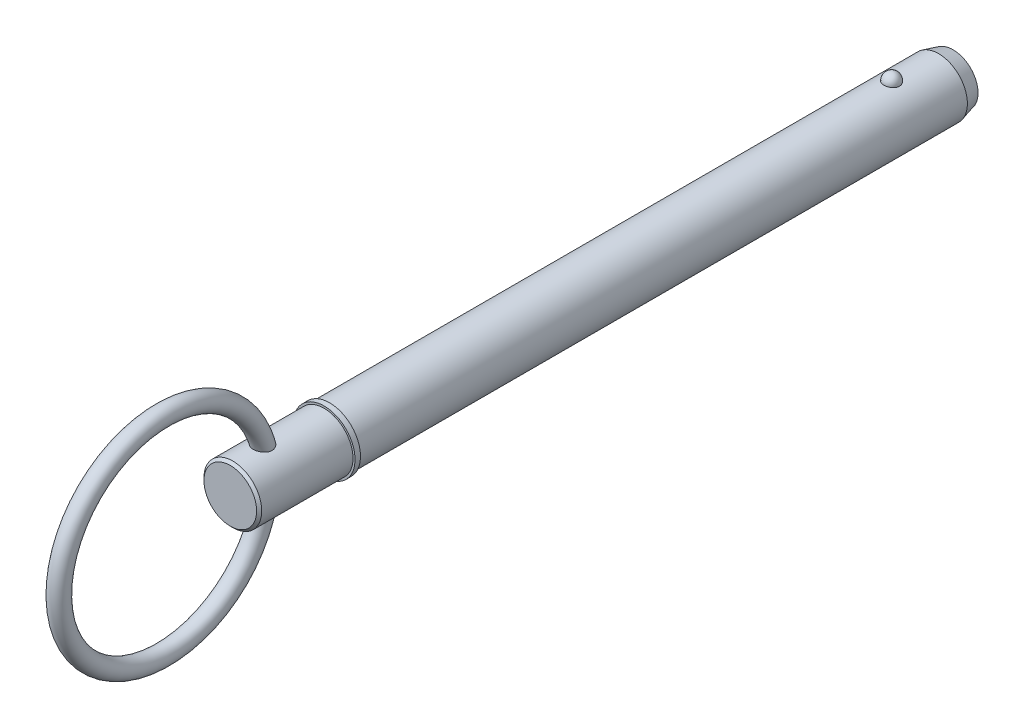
ISO-10303-21;
HEADER;
FILE_DESCRIPTION(('STEP AP214'),'2;1');
FILE_NAME('part.step','',(''),(''),'','','');
FILE_SCHEMA(('AUTOMOTIVE_DESIGN { 1 0 10303 214 1 1 1 1 }'));
ENDSEC;
DATA;
#1=APPLICATION_CONTEXT('core data for automotive mechanical design processes');
#2=APPLICATION_PROTOCOL_DEFINITION('international standard','automotive_design',2000,#1);
#3=PRODUCT_CONTEXT('',#1,'mechanical');
#4=PRODUCT('Part','Part','',(#3));
#5=PRODUCT_RELATED_PRODUCT_CATEGORY('part','',(#4));
#6=PRODUCT_DEFINITION_FORMATION('','',#4);
#7=PRODUCT_DEFINITION_CONTEXT('part definition',#1,'design');
#8=PRODUCT_DEFINITION('design','',#6,#7);
#9=PRODUCT_DEFINITION_SHAPE('','',#8);
#10=(LENGTH_UNIT() NAMED_UNIT(*) SI_UNIT(.MILLI.,.METRE.));
#11=(NAMED_UNIT(*) PLANE_ANGLE_UNIT() SI_UNIT($,.RADIAN.));
#12=(NAMED_UNIT(*) SI_UNIT($,.STERADIAN.) SOLID_ANGLE_UNIT());
#13=UNCERTAINTY_MEASURE_WITH_UNIT(LENGTH_MEASURE(1.E-05),#10,'distance_accuracy_value','');
#14=(GEOMETRIC_REPRESENTATION_CONTEXT(3) GLOBAL_UNCERTAINTY_ASSIGNED_CONTEXT((#13)) GLOBAL_UNIT_ASSIGNED_CONTEXT((#10,
#11,#12)) REPRESENTATION_CONTEXT('',''));
#15=CARTESIAN_POINT('',(0.,0.,0.));
#16=DIRECTION('',(0.,0.,1.));
#17=DIRECTION('',(1.,0.,0.));
#18=AXIS2_PLACEMENT_3D('',#15,#16,#17);
#19=CARTESIAN_POINT('',(0.,0.,152.4));
#20=DIRECTION('',(0.,0.,-1.));
#21=DIRECTION('',(-1.,0.,0.));
#22=AXIS2_PLACEMENT_3D('',#19,#20,#21);
#23=CYLINDRICAL_SURFACE('',#22,7.94);
#24=CARTESIAN_POINT('',(2.13020349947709,7.64891057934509,-2.14999999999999));
#25=CARTESIAN_POINT('',(2.1302012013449,7.64891247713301,-2.02978166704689));
#26=CARTESIAN_POINT('',(2.12037546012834,7.65166842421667,-1.90953383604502));
#27=CARTESIAN_POINT('',(2.08130792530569,7.66238579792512,-1.67243962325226));
#28=CARTESIAN_POINT('',(2.05205785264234,7.67034944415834,-1.55559471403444));
#29=CARTESIAN_POINT('',(1.97489181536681,7.69057749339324,-1.32869361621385));
#30=CARTESIAN_POINT('',(1.92698409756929,7.70283999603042,-1.21863445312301));
#31=CARTESIAN_POINT('',(1.81370645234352,7.73029430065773,-1.00831338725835));
#32=CARTESIAN_POINT('',(1.74833715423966,7.7454859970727,-0.908051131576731));
#33=CARTESIAN_POINT('',(1.60144242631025,7.77718699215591,-0.719628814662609));
#34=CARTESIAN_POINT('',(1.51984382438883,7.79370204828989,-0.631526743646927));
#35=CARTESIAN_POINT('',(1.34279837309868,7.82614685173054,-0.47041117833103));
#36=CARTESIAN_POINT('',(1.24735148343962,7.84207659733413,-0.39739772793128));
#37=CARTESIAN_POINT('',(1.04544839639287,7.87153116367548,-0.268681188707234));
#38=CARTESIAN_POINT('',(0.939022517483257,7.88506234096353,-0.212932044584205));
#39=CARTESIAN_POINT('',(0.717931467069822,7.90825597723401,-0.120080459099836));
#40=CARTESIAN_POINT('',(0.603267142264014,7.9179188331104,-0.0829761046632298));
#41=CARTESIAN_POINT('',(0.371015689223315,7.93216561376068,-0.0289596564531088));
#42=CARTESIAN_POINT('',(0.253510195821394,7.93683225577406,-0.0117183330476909));
#43=CARTESIAN_POINT('',(0.0171784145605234,7.94086051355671,0.00318921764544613));
#44=CARTESIAN_POINT('',(-0.101647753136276,7.94022260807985,0.000857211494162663));
#45=CARTESIAN_POINT('',(-0.335567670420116,7.93375751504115,-0.0231465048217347));
#46=CARTESIAN_POINT('',(-0.450690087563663,7.92799987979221,-0.0445590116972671));
#47=CARTESIAN_POINT('',(-0.675610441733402,7.91200792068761,-0.105760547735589));
#48=CARTESIAN_POINT('',(-0.785408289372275,7.90177352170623,-0.145549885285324));
#49=CARTESIAN_POINT('',(-0.997270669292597,7.87784802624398,-0.242675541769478));
#50=CARTESIAN_POINT('',(-1.0992893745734,7.86413823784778,-0.300107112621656));
#51=CARTESIAN_POINT('',(-1.29223659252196,7.83474718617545,-0.430887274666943));
#52=CARTESIAN_POINT('',(-1.38316404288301,7.81906573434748,-0.504237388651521));
#53=CARTESIAN_POINT('',(-1.55313516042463,7.78710451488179,-0.666358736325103));
#54=CARTESIAN_POINT('',(-1.63193689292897,7.77081906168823,-0.755382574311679));
#55=CARTESIAN_POINT('',(-1.77366356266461,7.73970270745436,-0.945507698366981));
#56=CARTESIAN_POINT('',(-1.83658745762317,7.72487190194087,-1.04660977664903));
#57=CARTESIAN_POINT('',(-1.94556640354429,7.6981535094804,-1.25927689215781));
#58=CARTESIAN_POINT('',(-1.99143480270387,7.6862989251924,-1.37094182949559));
#59=CARTESIAN_POINT('',(-2.06418311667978,7.66708387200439,-1.60066153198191));
#60=CARTESIAN_POINT('',(-2.0910635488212,7.65972328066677,-1.71871612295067));
#61=CARTESIAN_POINT('',(-2.12508507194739,7.65035479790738,-1.95736076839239));
#62=CARTESIAN_POINT('',(-2.13230490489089,7.64832555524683,-2.07793875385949));
#63=CARTESIAN_POINT('',(-2.12704767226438,7.64978921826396,-2.31862835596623));
#64=CARTESIAN_POINT('',(-2.1145710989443,7.6532819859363,-2.43873998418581));
#65=CARTESIAN_POINT('',(-2.07034166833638,7.66536368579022,-2.67451689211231));
#66=CARTESIAN_POINT('',(-2.03867758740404,7.67392914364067,-2.79020005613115));
#67=CARTESIAN_POINT('',(-1.95694065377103,7.69517736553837,-3.01446692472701));
#68=CARTESIAN_POINT('',(-1.90686710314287,7.70786028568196,-3.12305035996));
#69=CARTESIAN_POINT('',(-1.78925555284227,7.73600831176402,-3.33065971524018));
#70=CARTESIAN_POINT('',(-1.72162904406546,7.75148739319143,-3.42963360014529));
#71=CARTESIAN_POINT('',(-1.57074739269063,7.78346215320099,-3.61466914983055));
#72=CARTESIAN_POINT('',(-1.48749169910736,7.79995786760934,-3.70073035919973));
#73=CARTESIAN_POINT('',(-1.30720250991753,7.83219119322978,-3.8578359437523));
#74=CARTESIAN_POINT('',(-1.2101234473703,7.84792605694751,-3.92882863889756));
#75=CARTESIAN_POINT('',(-1.00503150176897,7.87681523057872,-4.05342383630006));
#76=CARTESIAN_POINT('',(-0.897019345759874,7.88996971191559,-4.10702749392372));
#77=CARTESIAN_POINT('',(-0.674439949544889,7.91208451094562,-4.19477736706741));
#78=CARTESIAN_POINT('',(-0.559965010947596,7.92109245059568,-4.22914554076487));
#79=CARTESIAN_POINT('',(-0.326625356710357,7.93413878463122,-4.27838865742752));
#80=CARTESIAN_POINT('',(-0.207761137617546,7.93817773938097,-4.29326579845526));
#81=CARTESIAN_POINT('',(0.0287357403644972,7.94081322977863,-4.3030062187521));
#82=CARTESIAN_POINT('',(0.146353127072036,7.93950453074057,-4.29821797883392));
#83=CARTESIAN_POINT('',(0.379062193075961,7.93180098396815,-4.26955229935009));
#84=CARTESIAN_POINT('',(0.494153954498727,7.92540630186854,-4.24567548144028));
#85=CARTESIAN_POINT('',(0.718185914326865,7.90824874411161,-4.17962260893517));
#86=CARTESIAN_POINT('',(0.827145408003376,7.89750055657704,-4.13750805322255));
#87=CARTESIAN_POINT('',(1.03638036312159,7.87277755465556,-4.03615078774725));
#88=CARTESIAN_POINT('',(1.13665531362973,7.85880255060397,-3.97690707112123));
#89=CARTESIAN_POINT('',(1.32729731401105,7.82887859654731,-3.84189297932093));
#90=CARTESIAN_POINT('',(1.41749828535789,7.81290379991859,-3.76589388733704));
#91=CARTESIAN_POINT('',(1.58397257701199,7.78086330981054,-3.59992466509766));
#92=CARTESIAN_POINT('',(1.66024342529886,7.76479760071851,-3.50995206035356));
#93=CARTESIAN_POINT('',(1.79805631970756,7.73405928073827,-3.31688321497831));
#94=CARTESIAN_POINT('',(1.85933944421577,7.719413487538,-3.213597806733));
#95=CARTESIAN_POINT('',(1.96397499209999,7.69345992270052,-2.99796163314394));
#96=CARTESIAN_POINT('',(2.00733488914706,7.68215076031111,-2.88561466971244));
#97=CARTESIAN_POINT('',(2.07068045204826,7.66529896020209,-2.6699413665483));
#98=CARTESIAN_POINT('',(2.09296296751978,7.65919990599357,-2.56732606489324));
#99=CARTESIAN_POINT('',(2.12272535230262,7.65100492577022,-2.35981463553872));
#100=CARTESIAN_POINT('',(2.13020550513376,7.64890892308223,-2.25491855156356));
#101=CARTESIAN_POINT('',(2.13020349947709,7.64891057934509,-2.14999999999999));
#102=B_SPLINE_CURVE_WITH_KNOTS('',3,(#24,#25,#26,#27,#28,#29,#30,#31,#32,#33,#34,#35,#36,#37,
#38,#39,#40,#41,#42,#43,#44,#45,#46,#47,#48,#49,#50,#51,#52,#53,#54,#55,#56,#57,#58,#59,#60,#61,
#62,#63,#64,#65,#66,#67,#68,#69,#70,#71,#72,#73,#74,#75,#76,#77,#78,#79,#80,#81,#82,#83,#84,#85,
#86,#87,#88,#89,#90,#91,#92,#93,#94,#95,#96,#97,#98,#99,#100,#101),.UNSPECIFIED.,.T.,.F.,(4,2,2,
2,2,2,2,2,2,2,2,2,2,2,2,2,2,2,2,2,2,2,2,2,2,2,2,2,2,2,2,2,2,2,2,2,2,2,4),(0.,0.360277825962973,
0.720709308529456,1.0809816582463,1.44124102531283,1.80316307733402,2.16508618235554,
2.52603531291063,2.88694740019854,3.24178717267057,3.59659491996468,3.94665496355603,
4.2967208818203,4.6487110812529,5.00073496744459,5.35906196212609,5.71741247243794,
6.079576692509,6.44173104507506,6.80243279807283,7.16312553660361,7.52216203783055,
7.88121215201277,8.24210915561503,8.60301888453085,8.96514709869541,9.32725124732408,
9.68508606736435,10.0428805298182,10.3943622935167,10.7458326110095,11.0961268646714,
11.4464417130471,11.8018724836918,12.1573662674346,12.5186252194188,12.8797333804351,
13.1941658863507,13.5085923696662),.UNSPECIFIED.);
#103=CARTESIAN_POINT('',(2.13020349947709,7.64891057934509,-2.14999999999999));
#104=VERTEX_POINT('',#103);
#105=EDGE_CURVE('E102',#104,#104,#102,.T.);
#106=ORIENTED_EDGE('',*,*,#105,.T.);
#107=EDGE_LOOP('',(#106));
#108=FACE_BOUND('',#107,.T.);
#109=CARTESIAN_POINT('',(0.,0.,-15.0500000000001));
#110=DIRECTION('',(0.,0.,-1.));
#111=DIRECTION('',(-1.,0.,0.));
#112=AXIS2_PLACEMENT_3D('',#109,#110,#111);
#113=CIRCLE('',#112,7.94);
#114=CARTESIAN_POINT('',(-7.94,0.,-15.0500000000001));
#115=VERTEX_POINT('',#114);
#116=EDGE_CURVE('E109',#115,#115,#113,.F.);
#117=ORIENTED_EDGE('',*,*,#116,.T.);
#118=EDGE_LOOP('',(#117));
#119=FACE_BOUND('',#118,.T.);
#120=CARTESIAN_POINT('',(0.,0.,152.4));
#121=DIRECTION('',(0.,0.,1.));
#122=DIRECTION('',(1.,0.,0.));
#123=AXIS2_PLACEMENT_3D('',#120,#121,#122);
#124=CIRCLE('',#123,7.94);
#125=CARTESIAN_POINT('',(7.94,0.,152.4));
#126=VERTEX_POINT('',#125);
#127=EDGE_CURVE('E107',#126,#126,#124,.T.);
#128=ORIENTED_EDGE('',*,*,#127,.F.);
#129=EDGE_LOOP('',(#128));
#130=FACE_BOUND('',#129,.T.);
#131=ADVANCED_FACE('F39',(#108,#119,#130),#23,.T.);
#132=CARTESIAN_POINT('',(0.,0.,-19.05));
#133=DIRECTION('',(0.,0.,-1.));
#134=DIRECTION('',(-1.,0.,0.));
#135=AXIS2_PLACEMENT_3D('',#132,#133,#134);
#136=PLANE('',#135);
#137=CARTESIAN_POINT('',(0.,0.,-19.05));
#138=DIRECTION('',(0.,0.,-1.));
#139=DIRECTION('',(-1.,0.,0.));
#140=AXIS2_PLACEMENT_3D('',#137,#138,#139);
#141=CIRCLE('',#140,6.86820323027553);
#142=CARTESIAN_POINT('',(-6.86820323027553,0.,-19.05));
#143=VERTEX_POINT('',#142);
#144=EDGE_CURVE('E143',#143,#143,#141,.T.);
#145=ORIENTED_EDGE('',*,*,#144,.T.);
#146=EDGE_LOOP('',(#145));
#147=FACE_BOUND('',#146,.T.);
#148=ADVANCED_FACE('F88',(#147),#136,.T.);
#149=CARTESIAN_POINT('',(0.,0.,-19.05));
#150=DIRECTION('',(0.,0.,1.));
#151=DIRECTION('',(1.,0.,0.));
#152=AXIS2_PLACEMENT_3D('',#149,#150,#151);
#153=CONICAL_SURFACE('',#152,6.86820323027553,0.261799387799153);
#154=ORIENTED_EDGE('',*,*,#116,.F.);
#155=EDGE_LOOP('',(#154));
#156=FACE_BOUND('',#155,.T.);
#157=ORIENTED_EDGE('',*,*,#144,.F.);
#158=EDGE_LOOP('',(#157));
#159=FACE_BOUND('',#158,.T.);
#160=ADVANCED_FACE('F94',(#156,#159),#153,.T.);
#161=CARTESIAN_POINT('',(0.,7.94,-2.14999999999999));
#162=DIRECTION('',(0.,1.,0.));
#163=DIRECTION('',(0.,0.,1.));
#164=AXIS2_PLACEMENT_3D('',#161,#162,#163);
#165=SPHERICAL_SURFACE('',#164,2.15);
#166=ORIENTED_EDGE('',*,*,#105,.F.);
#167=EDGE_LOOP('',(#166));
#168=FACE_BOUND('',#167,.T.);
#169=ADVANCED_FACE('F112',(#168),#165,.T.);
#170=CARTESIAN_POINT('',(0.,0.,152.4));
#171=DIRECTION('',(0.,0.,-1.));
#172=DIRECTION('',(-1.,0.,0.));
#173=AXIS2_PLACEMENT_3D('',#170,#171,#172);
#174=PLANE('',#173);
#175=ORIENTED_EDGE('',*,*,#127,.T.);
#176=EDGE_LOOP('',(#175));
#177=FACE_BOUND('',#176,.T.);
#178=CARTESIAN_POINT('',(0.,0.,152.4));
#179=DIRECTION('',(0.,0.,-1.));
#180=DIRECTION('',(-1.,0.,0.));
#181=AXIS2_PLACEMENT_3D('',#178,#179,#180);
#182=CIRCLE('',#181,8.5);
#183=CARTESIAN_POINT('',(-8.5,0.,152.4));
#184=VERTEX_POINT('',#183);
#185=EDGE_CURVE('E108',#184,#184,#182,.T.);
#186=ORIENTED_EDGE('',*,*,#185,.T.);
#187=EDGE_LOOP('',(#186));
#188=FACE_BOUND('',#187,.T.);
#189=ADVANCED_FACE('F116',(#177,#188),#174,.T.);
#190=CARTESIAN_POINT('',(0.,0.,33.7287874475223));
#191=DIRECTION('',(0.,0.,-1.));
#192=DIRECTION('',(-1.,0.,0.));
#193=AXIS2_PLACEMENT_3D('',#190,#191,#192);
#194=CYLINDRICAL_SURFACE('',#193,8.5);
#195=CARTESIAN_POINT('',(0.,0.,153.9));
#196=DIRECTION('',(0.,0.,-1.));
#197=DIRECTION('',(-1.,0.,0.));
#198=AXIS2_PLACEMENT_3D('',#195,#196,#197);
#199=CIRCLE('',#198,8.5);
#200=CARTESIAN_POINT('',(-8.5,0.,153.9));
#201=VERTEX_POINT('',#200);
#202=EDGE_CURVE('E133',#201,#201,#199,.T.);
#203=ORIENTED_EDGE('',*,*,#202,.T.);
#204=EDGE_LOOP('',(#203));
#205=FACE_BOUND('',#204,.T.);
#206=ORIENTED_EDGE('',*,*,#185,.F.);
#207=EDGE_LOOP('',(#206));
#208=FACE_BOUND('',#207,.T.);
#209=ADVANCED_FACE('F120',(#205,#208),#194,.T.);
#210=CARTESIAN_POINT('',(0.,8.5,153.9));
#211=DIRECTION('',(0.,0.,1.));
#212=DIRECTION('',(1.,0.,0.));
#213=AXIS2_PLACEMENT_3D('',#210,#211,#212);
#214=PLANE('',#213);
#215=CARTESIAN_POINT('',(0.,0.,153.9));
#216=DIRECTION('',(0.,0.,1.));
#217=DIRECTION('',(1.,0.,0.));
#218=AXIS2_PLACEMENT_3D('',#215,#216,#217);
#219=CIRCLE('',#218,7.94);
#220=CARTESIAN_POINT('',(7.94,0.,153.9));
#221=VERTEX_POINT('',#220);
#222=EDGE_CURVE('E111',#221,#221,#219,.T.);
#223=ORIENTED_EDGE('',*,*,#222,.F.);
#224=EDGE_LOOP('',(#223));
#225=FACE_BOUND('',#224,.T.);
#226=ORIENTED_EDGE('',*,*,#202,.F.);
#227=EDGE_LOOP('',(#226));
#228=FACE_BOUND('',#227,.T.);
#229=ADVANCED_FACE('F85',(#225,#228),#214,.T.);
#230=CARTESIAN_POINT('',(0.,0.,179.71));
#231=DIRECTION('',(0.,0.,-1.));
#232=DIRECTION('',(-1.,0.,0.));
#233=AXIS2_PLACEMENT_3D('',#230,#231,#232);
#234=CYLINDRICAL_SURFACE('',#233,7.94);
#235=CARTESIAN_POINT('',(-1.15544091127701,-7.85547938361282,168.511910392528));
#236=CARTESIAN_POINT('',(-1.03089695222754,-7.87379554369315,168.449615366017));
#237=CARTESIAN_POINT('',(-0.900845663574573,-7.8898743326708,168.397593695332));
#238=CARTESIAN_POINT('',(-0.63341751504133,-7.91583465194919,168.315265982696));
#239=CARTESIAN_POINT('',(-0.496037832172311,-7.92571377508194,168.284968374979));
#240=CARTESIAN_POINT('',(-0.217881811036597,-7.93823020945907,168.246773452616));
#241=CARTESIAN_POINT('',(-0.0771057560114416,-7.94086812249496,168.238874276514));
#242=CARTESIAN_POINT('',(0.203828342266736,-7.93862624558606,168.245648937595));
#243=CARTESIAN_POINT('',(0.34398643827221,-7.93374711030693,168.260320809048));
#244=CARTESIAN_POINT('',(0.619544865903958,-7.9169944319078,168.311877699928));
#245=CARTESIAN_POINT('',(0.754950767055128,-7.9051293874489,168.348735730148));
#246=CARTESIAN_POINT('',(1.0173752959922,-7.8756583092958,168.443842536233));
#247=CARTESIAN_POINT('',(1.14439334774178,-7.85805188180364,168.502092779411));
#248=CARTESIAN_POINT('',(1.38668443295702,-7.81893907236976,168.638842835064));
#249=CARTESIAN_POINT('',(1.50193494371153,-7.79742542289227,168.717380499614));
#250=CARTESIAN_POINT('',(1.71711272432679,-7.75288428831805,168.892872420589));
#251=CARTESIAN_POINT('',(1.81704089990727,-7.72985689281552,168.989825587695));
#252=CARTESIAN_POINT('',(1.99787261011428,-7.68509802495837,169.19887149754));
#253=CARTESIAN_POINT('',(2.07893183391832,-7.66335713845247,169.310827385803));
#254=CARTESIAN_POINT('',(2.22076589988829,-7.62346723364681,169.547480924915));
#255=CARTESIAN_POINT('',(2.28154607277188,-7.6053172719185,169.672175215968));
#256=CARTESIAN_POINT('',(2.38011540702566,-7.57504217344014,169.927618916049));
#257=CARTESIAN_POINT('',(2.41840843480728,-7.56278621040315,170.058158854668));
#258=CARTESIAN_POINT('',(2.47363993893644,-7.54490265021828,170.324095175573));
#259=CARTESIAN_POINT('',(2.49057788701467,-7.53927521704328,170.459491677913));
#260=CARTESIAN_POINT('',(2.50351014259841,-7.53499042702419,170.73242871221));
#261=CARTESIAN_POINT('',(2.49933630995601,-7.53638902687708,170.869977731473));
#262=CARTESIAN_POINT('',(2.47072547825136,-7.54581524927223,171.142698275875));
#263=CARTESIAN_POINT('',(2.44628184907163,-7.55384504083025,171.277869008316));
#264=CARTESIAN_POINT('',(2.37589315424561,-7.57629160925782,171.553085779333));
#265=CARTESIAN_POINT('',(2.32844094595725,-7.5911515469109,171.69270896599));
#266=CARTESIAN_POINT('',(2.21332780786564,-7.62550828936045,171.962781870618));
#267=CARTESIAN_POINT('',(2.14565489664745,-7.64500784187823,172.093226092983));
#268=CARTESIAN_POINT('',(1.98438755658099,-7.68852412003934,172.353702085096));
#269=CARTESIAN_POINT('',(1.88896913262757,-7.71279219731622,172.482569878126));
#270=CARTESIAN_POINT('',(1.67743245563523,-7.76154719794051,172.722112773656));
#271=CARTESIAN_POINT('',(1.56130644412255,-7.78603420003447,172.832781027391));
#272=CARTESIAN_POINT('',(1.31168281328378,-7.83191501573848,173.030100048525));
#273=CARTESIAN_POINT('',(1.17841631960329,-7.85334315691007,173.117029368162));
#274=CARTESIAN_POINT('',(0.967442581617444,-7.88116219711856,173.226657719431));
#275=CARTESIAN_POINT('',(0.895283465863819,-7.88971376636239,173.259736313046));
#276=CARTESIAN_POINT('',(0.747777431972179,-7.90505596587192,173.318400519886));
#277=CARTESIAN_POINT('',(0.672431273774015,-7.91184701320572,173.343987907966));
#278=CARTESIAN_POINT('',(0.530575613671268,-7.92252382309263,173.383912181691));
#279=CARTESIAN_POINT('',(0.464394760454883,-7.92668987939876,173.399349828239));
#280=CARTESIAN_POINT('',(0.330815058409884,-7.9333870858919,173.424069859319));
#281=CARTESIAN_POINT('',(0.263416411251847,-7.93591850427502,173.43335325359));
#282=CARTESIAN_POINT('',(0.128041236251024,-7.93925585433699,173.445577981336));
#283=CARTESIAN_POINT('',(0.0600650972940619,-7.94006286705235,173.448523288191));
#284=CARTESIAN_POINT('',(-0.075840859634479,-7.93992929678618,173.448033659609));
#285=CARTESIAN_POINT('',(-0.143770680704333,-7.93898884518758,173.444599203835));
#286=CARTESIAN_POINT('',(-0.330023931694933,-7.93402174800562,173.426406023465));
#287=CARTESIAN_POINT('',(-0.447720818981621,-7.92820264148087,173.405060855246));
#288=CARTESIAN_POINT('',(-0.677833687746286,-7.91185818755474,173.344093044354));
#289=CARTESIAN_POINT('',(-0.79024898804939,-7.90133223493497,173.304468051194));
#290=CARTESIAN_POINT('',(-1.01082100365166,-7.8762011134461,173.207436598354));
#291=CARTESIAN_POINT('',(-1.11873674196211,-7.86147932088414,173.149515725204));
#292=CARTESIAN_POINT('',(-1.32464461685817,-7.8294189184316,173.018755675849));
#293=CARTESIAN_POINT('',(-1.42263264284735,-7.81207923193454,172.945910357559));
#294=CARTESIAN_POINT('',(-1.62038324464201,-7.77363945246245,172.776536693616));
#295=CARTESIAN_POINT('',(-1.71849387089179,-7.75235190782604,172.678123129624));
#296=CARTESIAN_POINT('',(-1.89908721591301,-7.71010284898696,172.467783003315));
#297=CARTESIAN_POINT('',(-1.98155871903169,-7.68914157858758,172.355846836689));
#298=CARTESIAN_POINT('',(-2.13974270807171,-7.64674394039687,172.105108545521));
#299=CARTESIAN_POINT('',(-2.21304020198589,-7.62562536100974,171.964719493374));
#300=CARTESIAN_POINT('',(-2.33615659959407,-7.58881542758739,171.673266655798));
#301=CARTESIAN_POINT('',(-2.38596943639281,-7.57312547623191,171.522200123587));
#302=CARTESIAN_POINT('',(-2.46059473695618,-7.54921618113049,171.210492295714));
#303=CARTESIAN_POINT('',(-2.48494918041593,-7.54113395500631,171.049728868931));
#304=CARTESIAN_POINT('',(-2.50480773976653,-7.53456588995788,170.726244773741));
#305=CARTESIAN_POINT('',(-2.50033692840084,-7.53607171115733,170.563525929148));
#306=CARTESIAN_POINT('',(-2.46306926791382,-7.54832452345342,170.257165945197));
#307=CARTESIAN_POINT('',(-2.43295696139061,-7.55819528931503,170.113162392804));
#308=CARTESIAN_POINT('',(-2.34806892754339,-7.58499431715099,169.833304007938));
#309=CARTESIAN_POINT('',(-2.29330013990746,-7.60192059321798,169.697446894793));
#310=CARTESIAN_POINT('',(-2.1652372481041,-7.63933506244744,169.44765733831));
#311=CARTESIAN_POINT('',(-2.09353456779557,-7.65948502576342,169.332853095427));
#312=CARTESIAN_POINT('',(-1.93200913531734,-7.7018104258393,169.117268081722));
#313=CARTESIAN_POINT('',(-1.842192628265,-7.72398516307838,169.016482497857));
#314=CARTESIAN_POINT('',(-1.65746337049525,-7.76558957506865,168.84131484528));
#315=CARTESIAN_POINT('',(-1.56413624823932,-7.78505810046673,168.765259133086));
#316=CARTESIAN_POINT('',(-1.36706423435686,-7.82207051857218,168.62753576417));
#317=CARTESIAN_POINT('',(-1.26331856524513,-7.83961426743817,168.565869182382));
#318=CARTESIAN_POINT('',(-1.15544091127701,-7.85547938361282,168.511910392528));
#319=B_SPLINE_CURVE_WITH_KNOTS('',3,(#235,#236,#237,#238,#239,#240,#241,#242,#243,#244,#245,
#246,#247,#248,#249,#250,#251,#252,#253,#254,#255,#256,#257,#258,#259,#260,#261,#262,#263,#264,
#265,#266,#267,#268,#269,#270,#271,#272,#273,#274,#275,#276,#277,#278,#279,#280,#281,#282,#283,
#284,#285,#286,#287,#288,#289,#290,#291,#292,#293,#294,#295,#296,#297,#298,#299,#300,#301,#302,
#303,#304,#305,#306,#307,#308,#309,#310,#311,#312,#313,#314,#315,#316,#317,#318),.UNSPECIFIED.,
.T.,.F.,(4,2,2,2,2,2,2,2,2,2,2,2,2,2,2,2,2,2,2,2,2,2,2,2,2,2,2,2,2,2,2,2,2,2,2,2,2,2,2,2,2,4),
(0.,0.420927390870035,0.842018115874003,1.26307384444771,1.68409290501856,2.10460083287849,
2.52513760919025,2.94646475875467,3.36776699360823,3.78545897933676,4.20304108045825,
4.61086922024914,5.01870744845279,5.42979890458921,5.84102487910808,6.28383316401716,
6.72690434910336,7.21113455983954,7.69554657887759,8.17400305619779,8.41316278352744,
8.65226580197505,8.85622998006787,9.06016068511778,9.26396350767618,9.4677510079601,
9.82521046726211,10.1827159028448,10.5513335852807,10.9201032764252,11.3402098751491,
11.7606166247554,12.2377707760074,12.715048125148,13.2007716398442,13.6860727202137,
14.1260485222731,14.5659005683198,14.9745225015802,15.3830037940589,15.7475760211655,
16.1121754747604),.UNSPECIFIED.);
#320=CARTESIAN_POINT('',(-1.15544091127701,-7.85547938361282,168.511910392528));
#321=VERTEX_POINT('',#320);
#322=EDGE_CURVE('E10',#321,#321,#319,.T.);
#323=ORIENTED_EDGE('',*,*,#322,.F.);
#324=EDGE_LOOP('',(#323));
#325=FACE_BOUND('',#324,.T.);
#326=CARTESIAN_POINT('',(-1.15544091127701,7.85547938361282,168.511910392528));
#327=CARTESIAN_POINT('',(-1.278579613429,7.83736699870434,168.573507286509));
#328=CARTESIAN_POINT('',(-1.39638360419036,7.8170599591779,168.645172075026));
#329=CARTESIAN_POINT('',(-1.61803025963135,7.77421032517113,168.80708252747));
#330=CARTESIAN_POINT('',(-1.72186951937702,7.7516671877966,168.897332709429));
#331=CARTESIAN_POINT('',(-1.9126968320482,7.70680387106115,169.094395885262));
#332=CARTESIAN_POINT('',(-1.99967065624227,7.68448389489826,169.201222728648));
#333=CARTESIAN_POINT('',(-2.15412555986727,7.64262858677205,169.428607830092));
#334=CARTESIAN_POINT('',(-2.2216118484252,7.62309251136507,169.549162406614));
#335=CARTESIAN_POINT('',(-2.3342927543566,7.5893410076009,169.798377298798));
#336=CARTESIAN_POINT('',(-2.3798562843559,7.57503857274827,169.926859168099));
#337=CARTESIAN_POINT('',(-2.44955571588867,7.55278941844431,170.190011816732));
#338=CARTESIAN_POINT('',(-2.47369226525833,7.544842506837,170.32468240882));
#339=CARTESIAN_POINT('',(-2.50059611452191,7.53596831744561,170.596137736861));
#340=CARTESIAN_POINT('',(-2.50339277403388,7.53503139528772,170.732919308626));
#341=CARTESIAN_POINT('',(-2.48855779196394,7.53994222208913,171.005224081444));
#342=CARTESIAN_POINT('',(-2.47092012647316,7.54579197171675,171.14074689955));
#343=CARTESIAN_POINT('',(-2.41469361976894,7.56397908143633,171.416293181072));
#344=CARTESIAN_POINT('',(-2.37479606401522,7.57671999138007,171.55602135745));
#345=CARTESIAN_POINT('',(-2.27489955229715,7.60730881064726,171.827515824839));
#346=CARTESIAN_POINT('',(-2.2148900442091,7.6251594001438,171.959277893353));
#347=CARTESIAN_POINT('',(-2.06943931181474,7.66598084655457,172.22452508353));
#348=CARTESIAN_POINT('',(-1.98208275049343,7.68928197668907,172.356914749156));
#349=CARTESIAN_POINT('',(-1.78658869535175,7.73704343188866,172.605235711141));
#350=CARTESIAN_POINT('',(-1.67843905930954,7.76150442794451,172.721157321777));
#351=CARTESIAN_POINT('',(-1.44142605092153,7.80900750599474,172.933699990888));
#352=CARTESIAN_POINT('',(-1.31231821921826,7.83202775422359,173.030058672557));
#353=CARTESIAN_POINT('',(-1.10627655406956,7.86286215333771,173.154614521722));
#354=CARTESIAN_POINT('',(-1.03552563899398,7.87252500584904,173.192805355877));
#355=CARTESIAN_POINT('',(-0.890375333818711,7.89025728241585,173.261885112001));
#356=CARTESIAN_POINT('',(-0.815978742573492,7.89832790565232,173.292779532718));
#357=CARTESIAN_POINT('',(-0.674180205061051,7.91160332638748,173.343082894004));
#358=CARTESIAN_POINT('',(-0.607145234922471,7.91704543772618,173.363468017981));
#359=CARTESIAN_POINT('',(-0.471385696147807,7.92628663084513,173.397876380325));
#360=CARTESIAN_POINT('',(-0.402662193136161,7.93008672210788,173.411903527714));
#361=CARTESIAN_POINT('',(-0.26415304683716,7.9359070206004,173.433322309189));
#362=CARTESIAN_POINT('',(-0.194368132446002,7.9379283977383,173.440718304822));
#363=CARTESIAN_POINT('',(-0.0544054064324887,7.940122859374,173.448743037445));
#364=CARTESIAN_POINT('',(0.015772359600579,7.94029615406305,173.449372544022));
#365=CARTESIAN_POINT('',(0.206295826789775,7.93822912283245,173.441825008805));
#366=CARTESIAN_POINT('',(0.326425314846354,7.93416340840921,173.426989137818));
#367=CARTESIAN_POINT('',(0.562310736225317,7.92094769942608,173.378077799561));
#368=CARTESIAN_POINT('',(0.678066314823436,7.91179729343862,173.34400077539));
#369=CARTESIAN_POINT('',(0.903029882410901,7.88929555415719,173.258269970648));
#370=CARTESIAN_POINT('',(1.01220356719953,7.87592415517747,173.206532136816));
#371=CARTESIAN_POINT('',(1.22142047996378,7.84620431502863,173.087793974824));
#372=CARTESIAN_POINT('',(1.32146048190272,7.82985482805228,173.020788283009));
#373=CARTESIAN_POINT('',(1.52328754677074,7.7932678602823,172.864309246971));
#374=CARTESIAN_POINT('',(1.62365085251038,7.77280069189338,172.773056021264));
#375=CARTESIAN_POINT('',(1.80985117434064,7.73156849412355,172.576815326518));
#376=CARTESIAN_POINT('',(1.895678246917,7.71080327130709,172.47181854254));
#377=CARTESIAN_POINT('',(2.06302404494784,7.66785771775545,172.234543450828));
#378=CARTESIAN_POINT('',(2.14213178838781,7.64590590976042,172.100514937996));
#379=CARTESIAN_POINT('',(2.27825755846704,7.60645646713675,171.820994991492));
#380=CARTESIAN_POINT('',(2.33526577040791,7.58896081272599,171.675498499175));
#381=CARTESIAN_POINT('',(2.42707573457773,7.56011538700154,171.370242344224));
#382=CARTESIAN_POINT('',(2.46084599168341,7.54905411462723,171.210140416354));
#383=CARTESIAN_POINT('',(2.49980168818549,7.53624914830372,170.886129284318));
#384=CARTESIAN_POINT('',(2.50500938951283,7.5344981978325,170.722223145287));
#385=CARTESIAN_POINT('',(2.48594104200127,7.54080673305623,170.409976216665));
#386=CARTESIAN_POINT('',(2.46407777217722,7.54806351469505,170.261473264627));
#387=CARTESIAN_POINT('',(2.3945479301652,7.57040718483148,169.971258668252));
#388=CARTESIAN_POINT('',(2.34689355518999,7.58549037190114,169.829543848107));
#389=CARTESIAN_POINT('',(2.2318274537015,7.62009243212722,169.569141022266));
#390=CARTESIAN_POINT('',(2.16637710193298,7.63914093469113,169.449517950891));
#391=CARTESIAN_POINT('',(2.01638736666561,7.68009146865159,169.22346099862));
#392=CARTESIAN_POINT('',(1.93184850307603,7.70199342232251,169.117026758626));
#393=CARTESIAN_POINT('',(1.74664202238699,7.74608439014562,168.92066977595));
#394=CARTESIAN_POINT('',(1.646079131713,7.76827073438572,168.83064744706));
#395=CARTESIAN_POINT('',(1.43119791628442,7.81071401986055,168.668308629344));
#396=CARTESIAN_POINT('',(1.31687846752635,7.83097080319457,168.595993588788));
#397=CARTESIAN_POINT('',(1.07477437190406,7.86789551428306,168.469149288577));
#398=CARTESIAN_POINT('',(0.946739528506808,7.88446964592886,168.415069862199));
#399=CARTESIAN_POINT('',(0.683029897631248,7.91167708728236,168.328213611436));
#400=CARTESIAN_POINT('',(0.547354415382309,7.92230985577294,168.295438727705));
#401=CARTESIAN_POINT('',(0.271066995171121,7.93658630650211,168.251730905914));
#402=CARTESIAN_POINT('',(0.130424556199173,7.94017418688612,168.240972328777));
#403=CARTESIAN_POINT('',(-0.150736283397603,7.93981282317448,168.242062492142));
#404=CARTESIAN_POINT('',(-0.291254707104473,7.93586558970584,168.253905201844));
#405=CARTESIAN_POINT('',(-0.556023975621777,7.92151946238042,168.297891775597));
#406=CARTESIAN_POINT('',(-0.68062174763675,7.91171585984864,168.328166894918));
#407=CARTESIAN_POINT('',(-0.923476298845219,7.88705844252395,168.406736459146));
#408=CARTESIAN_POINT('',(-1.04173303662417,7.87220459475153,168.455031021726));
#409=CARTESIAN_POINT('',(-1.15544091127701,7.85547938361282,168.511910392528));
#410=B_SPLINE_CURVE_WITH_KNOTS('',3,(#326,#327,#328,#329,#330,#331,#332,#333,#334,#335,#336,
#337,#338,#339,#340,#341,#342,#343,#344,#345,#346,#347,#348,#349,#350,#351,#352,#353,#354,#355,
#356,#357,#358,#359,#360,#361,#362,#363,#364,#365,#366,#367,#368,#369,#370,#371,#372,#373,#374,
#375,#376,#377,#378,#379,#380,#381,#382,#383,#384,#385,#386,#387,#388,#389,#390,#391,#392,#393,
#394,#395,#396,#397,#398,#399,#400,#401,#402,#403,#404,#405,#406,#407,#408,#409),.UNSPECIFIED.,
.T.,.F.,(4,2,2,2,2,2,2,2,2,2,2,2,2,2,2,2,2,2,2,2,2,2,2,2,2,2,2,2,2,2,2,2,2,2,2,2,2,2,2,2,2,4),
(0.,0.416167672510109,0.83243663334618,1.2490552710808,1.66556244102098,2.07479168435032,
2.48400855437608,2.89266231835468,3.30143658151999,3.7372506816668,4.17329379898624,
4.65204873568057,5.13108409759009,5.61617224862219,5.85876072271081,6.10116578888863,
6.31168904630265,6.52208269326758,6.7323378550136,6.94256910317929,7.30398888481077,
7.66543791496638,8.02863174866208,8.39195337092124,8.801906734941,9.21213940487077,
9.68159903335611,10.1512669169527,10.6406305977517,11.1296128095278,11.5779838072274,
12.0261429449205,12.4372146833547,12.8482752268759,13.256751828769,13.6652618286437,
14.0832160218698,14.5012082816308,14.9224982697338,15.3436758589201,15.72796797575,
16.1122626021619),.UNSPECIFIED.);
#411=CARTESIAN_POINT('',(-1.15544091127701,7.85547938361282,168.511910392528));
#412=VERTEX_POINT('',#411);
#413=EDGE_CURVE('E51',#412,#412,#410,.T.);
#414=ORIENTED_EDGE('',*,*,#413,.F.);
#415=EDGE_LOOP('',(#414));
#416=FACE_BOUND('',#415,.T.);
#417=CARTESIAN_POINT('',(0.,0.,179.01));
#418=DIRECTION('',(0.,0.,-1.));
#419=DIRECTION('',(-1.,0.,0.));
#420=AXIS2_PLACEMENT_3D('',#417,#418,#419);
#421=CIRCLE('',#420,7.94);
#422=CARTESIAN_POINT('',(-7.94,0.,179.01));
#423=VERTEX_POINT('',#422);
#424=EDGE_CURVE('E64',#423,#423,#421,.T.);
#425=ORIENTED_EDGE('',*,*,#424,.T.);
#426=EDGE_LOOP('',(#425));
#427=FACE_BOUND('',#426,.T.);
#428=ORIENTED_EDGE('',*,*,#222,.T.);
#429=EDGE_LOOP('',(#428));
#430=FACE_BOUND('',#429,.T.);
#431=ADVANCED_FACE('F69',(#325,#416,#427,#430),#234,.T.);
#432=CARTESIAN_POINT('',(0.,0.,179.71));
#433=DIRECTION('',(0.,0.,-1.));
#434=DIRECTION('',(-1.,0.,0.));
#435=AXIS2_PLACEMENT_3D('',#432,#433,#434);
#436=PLANE('',#435);
#437=CARTESIAN_POINT('',(0.,0.,179.71));
#438=DIRECTION('',(0.,0.,-1.));
#439=DIRECTION('',(-1.,0.,0.));
#440=AXIS2_PLACEMENT_3D('',#437,#438,#439);
#441=CIRCLE('',#440,7.24);
#442=CARTESIAN_POINT('',(-7.24,0.,179.71));
#443=VERTEX_POINT('',#442);
#444=EDGE_CURVE('E57',#443,#443,#441,.F.);
#445=ORIENTED_EDGE('',*,*,#444,.T.);
#446=EDGE_LOOP('',(#445));
#447=FACE_BOUND('',#446,.T.);
#448=ADVANCED_FACE('F76',(#447),#436,.F.);
#449=CARTESIAN_POINT('',(0.,0.,179.01));
#450=DIRECTION('',(0.,0.,-1.));
#451=DIRECTION('',(-1.,0.,0.));
#452=AXIS2_PLACEMENT_3D('',#449,#450,#451);
#453=CONICAL_SURFACE('',#452,7.94,0.785398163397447);
#454=ORIENTED_EDGE('',*,*,#444,.F.);
#455=EDGE_LOOP('',(#454));
#456=FACE_BOUND('',#455,.T.);
#457=ORIENTED_EDGE('',*,*,#424,.F.);
#458=EDGE_LOOP('',(#457));
#459=FACE_BOUND('',#458,.T.);
#460=ADVANCED_FACE('F41',(#456,#459),#453,.T.);
#461=CARTESIAN_POINT('',(0.,0.,198.285));
#462=DIRECTION('',(1.,0.,0.));
#463=DIRECTION('',(0.,0.,-1.));
#464=AXIS2_PLACEMENT_3D('',#461,#462,#463);
#465=TOROIDAL_SURFACE('',#464,28.575,2.5);
#466=ORIENTED_EDGE('',*,*,#322,.T.);
#467=EDGE_LOOP('',(#466));
#468=FACE_BOUND('',#467,.T.);
#469=ORIENTED_EDGE('',*,*,#413,.T.);
#470=EDGE_LOOP('',(#469));
#471=FACE_BOUND('',#470,.T.);
#472=ADVANCED_FACE('F73',(#468,#471),#465,.T.);
#473=CLOSED_SHELL('',(#131,#148,#160,#169,#189,#209,#229,#431,#448,#460,#472));
#474=MANIFOLD_SOLID_BREP('B2',#473);
#475=ADVANCED_BREP_SHAPE_REPRESENTATION('',(#18,#474),#14);
#476=SHAPE_DEFINITION_REPRESENTATION(#9,#475);
ENDSEC;
END-ISO-10303-21;
